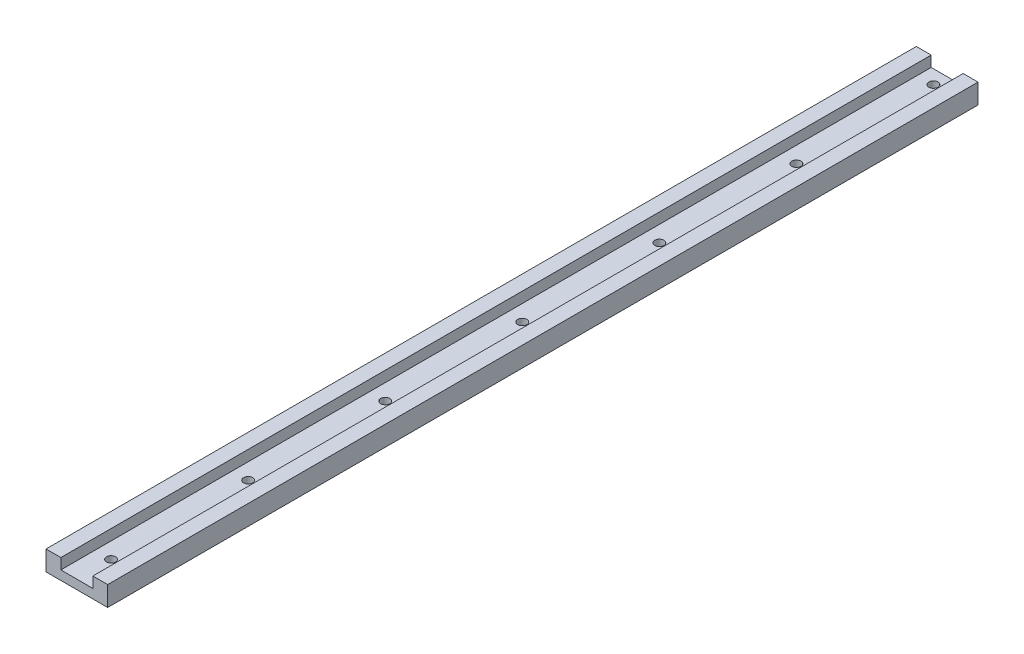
from build123d import *

# Parameters (mm, degrees)
BOSS_EXTRUDE1_DEPTH = 381
SKETCH2_R           = 2
CUT_EXTRUDE1_DEPTH  = 382.268068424
LPATTERN1_COUNT     = 10
LPATTERN1_PITCH     = 60


with BuildPart() as part:
    # Sketch1 → Boss-Extrude1 (new body)
    with BuildSketch(Plane.XY):
        Polygon((7, 4.35), (13.5, 4.35), (13.5, -4.35), (-13.5, -4.35), (-13.5, 4.35), (-7, 4.35), (-7, -0.35), (7, -0.35), align=None)
    extrude(amount=BOSS_EXTRUDE1_DEPTH)

    # Sketch2 → Cut-Extrude1 (cut, through all)
    with BuildSketch(Plane(origin=(0, -0.35, 0), x_dir=(1, 0, 0), z_dir=(0, 1, 0))):
        with Locations(Location((0, -366, 0), (0, 0, 180))):
            Circle(SKETCH2_R)
    cut_extrude1 = extrude(amount=-CUT_EXTRUDE1_DEPTH, mode=Mode.SUBTRACT)

    # LPattern1: Cut-Extrude1 ×10
    with Locations(*[(0, 0, -i * LPATTERN1_PITCH) for i in range(1, LPATTERN1_COUNT)]):
        add(cut_extrude1, mode=Mode.SUBTRACT)


solid = part.part
